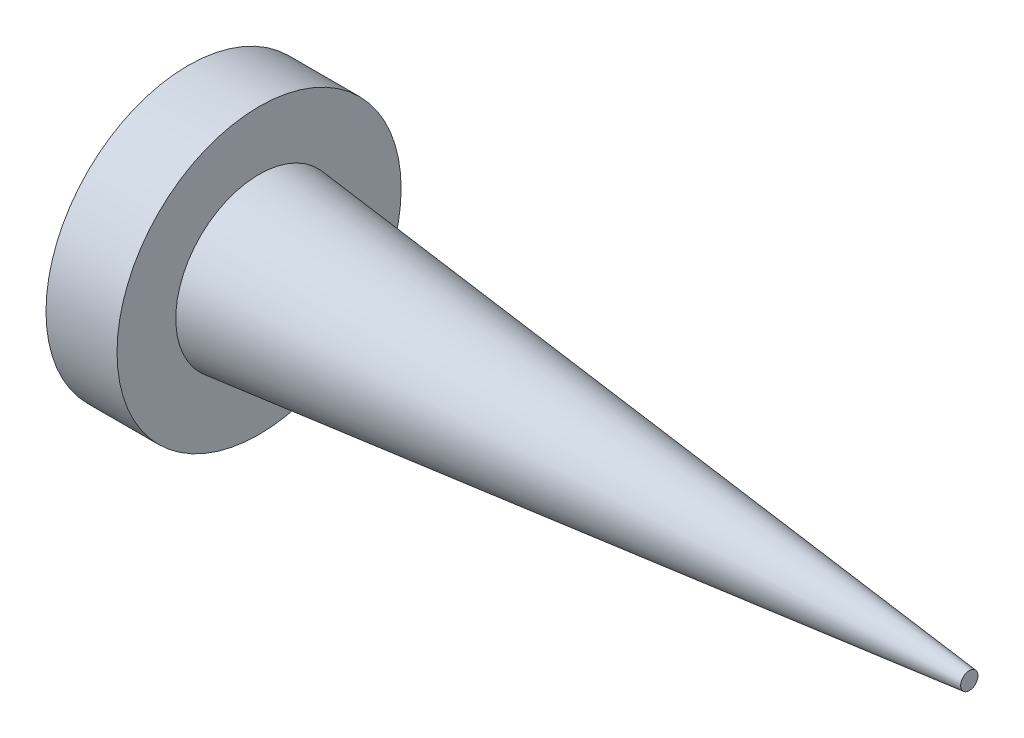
ISO-10303-21;
HEADER;
FILE_DESCRIPTION(('STEP AP214'),'2;1');
FILE_NAME('part.step','',(''),(''),'','','');
FILE_SCHEMA(('AUTOMOTIVE_DESIGN { 1 0 10303 214 1 1 1 1 }'));
ENDSEC;
DATA;
#1=APPLICATION_CONTEXT('core data for automotive mechanical design processes');
#2=APPLICATION_PROTOCOL_DEFINITION('international standard','automotive_design',2000,#1);
#3=PRODUCT_CONTEXT('',#1,'mechanical');
#4=PRODUCT('Part','Part','',(#3));
#5=PRODUCT_RELATED_PRODUCT_CATEGORY('part','',(#4));
#6=PRODUCT_DEFINITION_FORMATION('','',#4);
#7=PRODUCT_DEFINITION_CONTEXT('part definition',#1,'design');
#8=PRODUCT_DEFINITION('design','',#6,#7);
#9=PRODUCT_DEFINITION_SHAPE('','',#8);
#10=(LENGTH_UNIT() NAMED_UNIT(*) SI_UNIT(.MILLI.,.METRE.));
#11=(NAMED_UNIT(*) PLANE_ANGLE_UNIT() SI_UNIT($,.RADIAN.));
#12=(NAMED_UNIT(*) SI_UNIT($,.STERADIAN.) SOLID_ANGLE_UNIT());
#13=UNCERTAINTY_MEASURE_WITH_UNIT(LENGTH_MEASURE(1.E-05),#10,'distance_accuracy_value','');
#14=(GEOMETRIC_REPRESENTATION_CONTEXT(3) GLOBAL_UNCERTAINTY_ASSIGNED_CONTEXT((#13)) GLOBAL_UNIT_ASSIGNED_CONTEXT((#10,
#11,#12)) REPRESENTATION_CONTEXT('',''));
#15=CARTESIAN_POINT('',(0.,0.,0.));
#16=DIRECTION('',(0.,0.,1.));
#17=DIRECTION('',(1.,0.,0.));
#18=AXIS2_PLACEMENT_3D('',#15,#16,#17);
#19=CARTESIAN_POINT('',(1.,0.,0.));
#20=DIRECTION('',(-1.,0.,0.));
#21=DIRECTION('',(0.,0.,1.));
#22=AXIS2_PLACEMENT_3D('',#19,#20,#21);
#23=CYLINDRICAL_SURFACE('',#22,2.);
#24=CARTESIAN_POINT('',(1.,0.,0.));
#25=DIRECTION('',(1.,0.,0.));
#26=DIRECTION('',(0.,0.,-1.));
#27=AXIS2_PLACEMENT_3D('',#24,#25,#26);
#28=CIRCLE('',#27,2.);
#29=CARTESIAN_POINT('',(1.,0.,-2.));
#30=VERTEX_POINT('',#29);
#31=EDGE_CURVE('E38',#30,#30,#28,.T.);
#32=ORIENTED_EDGE('',*,*,#31,.F.);
#33=EDGE_LOOP('',(#32));
#34=FACE_BOUND('',#33,.T.);
#35=CARTESIAN_POINT('',(0.,0.,0.));
#36=DIRECTION('',(1.,0.,0.));
#37=DIRECTION('',(0.,0.,-1.));
#38=AXIS2_PLACEMENT_3D('',#35,#36,#37);
#39=CIRCLE('',#38,2.);
#40=CARTESIAN_POINT('',(0.,0.,-2.));
#41=VERTEX_POINT('',#40);
#42=EDGE_CURVE('E34',#41,#41,#39,.T.);
#43=ORIENTED_EDGE('',*,*,#42,.T.);
#44=EDGE_LOOP('',(#43));
#45=FACE_BOUND('',#44,.T.);
#46=ADVANCED_FACE('F31',(#34,#45),#23,.T.);
#47=CARTESIAN_POINT('',(1.,0.,0.));
#48=DIRECTION('',(1.,0.,0.));
#49=DIRECTION('',(0.,0.,-1.));
#50=AXIS2_PLACEMENT_3D('',#47,#48,#49);
#51=PLANE('',#50);
#52=CARTESIAN_POINT('',(1.,0.,0.));
#53=DIRECTION('',(1.,0.,0.));
#54=DIRECTION('',(0.,0.,-1.));
#55=AXIS2_PLACEMENT_3D('',#52,#53,#54);
#56=CIRCLE('',#55,1.17321010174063);
#57=CARTESIAN_POINT('',(1.,0.,-1.17321010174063));
#58=VERTEX_POINT('',#57);
#59=EDGE_CURVE('E10',#58,#58,#56,.T.);
#60=ORIENTED_EDGE('',*,*,#59,.F.);
#61=EDGE_LOOP('',(#60));
#62=FACE_BOUND('',#61,.T.);
#63=ORIENTED_EDGE('',*,*,#31,.T.);
#64=EDGE_LOOP('',(#63));
#65=FACE_BOUND('',#64,.T.);
#66=ADVANCED_FACE('F55',(#62,#65),#51,.T.);
#67=CARTESIAN_POINT('',(0.,0.,0.));
#68=DIRECTION('',(1.,0.,0.));
#69=DIRECTION('',(0.,0.,-1.));
#70=AXIS2_PLACEMENT_3D('',#67,#68,#69);
#71=PLANE('',#70);
#72=ORIENTED_EDGE('',*,*,#42,.F.);
#73=EDGE_LOOP('',(#72));
#74=FACE_BOUND('',#73,.T.);
#75=ADVANCED_FACE('F52',(#74),#71,.F.);
#76=CARTESIAN_POINT('',(1.,0.,0.));
#77=DIRECTION('',(-1.,0.,0.));
#78=DIRECTION('',(0.,0.,-1.));
#79=AXIS2_PLACEMENT_3D('',#76,#77,#78);
#80=CONICAL_SURFACE('',#79,1.17321010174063,0.10471975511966);
#81=CARTESIAN_POINT('',(11.,0.,0.));
#82=DIRECTION('',(1.,0.,0.));
#83=DIRECTION('',(0.,0.,-1.));
#84=AXIS2_PLACEMENT_3D('',#81,#82,#83);
#85=CIRCLE('',#84,0.122167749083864);
#86=CARTESIAN_POINT('',(11.,0.,-0.122167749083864));
#87=VERTEX_POINT('',#86);
#88=EDGE_CURVE('E44',#87,#87,#85,.T.);
#89=CARTESIAN_POINT('',(11.,0.,-0.122167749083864));
#90=CARTESIAN_POINT('',(10.8958333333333,0.,-0.133116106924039));
#91=CARTESIAN_POINT('',(10.7916666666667,0.,-0.144064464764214));
#92=CARTESIAN_POINT('',(10.5833333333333,0.,-0.165961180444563));
#93=CARTESIAN_POINT('',(10.4791666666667,0.,-0.176909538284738));
#94=CARTESIAN_POINT('',(10.2708333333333,0.,-0.198806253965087));
#95=CARTESIAN_POINT('',(10.1666666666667,0.,-0.209754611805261));
#96=CARTESIAN_POINT('',(9.95833333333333,0.,-0.231651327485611));
#97=CARTESIAN_POINT('',(9.85416666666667,0.,-0.242599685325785));
#98=CARTESIAN_POINT('',(9.64583333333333,0.,-0.264496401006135));
#99=CARTESIAN_POINT('',(9.54166666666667,0.,-0.275444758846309));
#100=CARTESIAN_POINT('',(9.33333333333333,0.,-0.297341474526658));
#101=CARTESIAN_POINT('',(9.22916666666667,0.,-0.308289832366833));
#102=CARTESIAN_POINT('',(9.02083333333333,0.,-0.330186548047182));
#103=CARTESIAN_POINT('',(8.91666666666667,0.,-0.341134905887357));
#104=CARTESIAN_POINT('',(8.70833333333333,0.,-0.363031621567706));
#105=CARTESIAN_POINT('',(8.60416666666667,0.,-0.373979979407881));
#106=CARTESIAN_POINT('',(8.39583333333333,0.,-0.39587669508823));
#107=CARTESIAN_POINT('',(8.29166666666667,0.,-0.406825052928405));
#108=CARTESIAN_POINT('',(8.08333333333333,0.,-0.428721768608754));
#109=CARTESIAN_POINT('',(7.97916666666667,0.,-0.439670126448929));
#110=CARTESIAN_POINT('',(7.77083333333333,0.,-0.461566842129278));
#111=CARTESIAN_POINT('',(7.66666666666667,0.,-0.472515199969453));
#112=CARTESIAN_POINT('',(7.45833333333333,0.,-0.494411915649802));
#113=CARTESIAN_POINT('',(7.35416666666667,0.,-0.505360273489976));
#114=CARTESIAN_POINT('',(7.14583333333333,0.,-0.527256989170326));
#115=CARTESIAN_POINT('',(7.04166666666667,0.,-0.5382053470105));
#116=CARTESIAN_POINT('',(6.83333333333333,0.,-0.56010206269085));
#117=CARTESIAN_POINT('',(6.72916666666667,0.,-0.571050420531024));
#118=CARTESIAN_POINT('',(6.52083333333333,0.,-0.592947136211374));
#119=CARTESIAN_POINT('',(6.41666666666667,0.,-0.603895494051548));
#120=CARTESIAN_POINT('',(6.20833333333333,0.,-0.625792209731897));
#121=CARTESIAN_POINT('',(6.10416666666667,0.,-0.636740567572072));
#122=CARTESIAN_POINT('',(5.89583333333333,0.,-0.658637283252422));
#123=CARTESIAN_POINT('',(5.79166666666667,0.,-0.669585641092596));
#124=CARTESIAN_POINT('',(5.58333333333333,0.,-0.691482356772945));
#125=CARTESIAN_POINT('',(5.47916666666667,0.,-0.70243071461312));
#126=CARTESIAN_POINT('',(5.27083333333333,0.,-0.724327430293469));
#127=CARTESIAN_POINT('',(5.16666666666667,0.,-0.735275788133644));
#128=CARTESIAN_POINT('',(4.95833333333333,0.,-0.757172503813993));
#129=CARTESIAN_POINT('',(4.85416666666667,0.,-0.768120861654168));
#130=CARTESIAN_POINT('',(4.64583333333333,0.,-0.790017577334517));
#131=CARTESIAN_POINT('',(4.54166666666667,0.,-0.800965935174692));
#132=CARTESIAN_POINT('',(4.33333333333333,0.,-0.822862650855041));
#133=CARTESIAN_POINT('',(4.22916666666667,0.,-0.833811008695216));
#134=CARTESIAN_POINT('',(4.02083333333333,0.,-0.855707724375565));
#135=CARTESIAN_POINT('',(3.91666666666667,0.,-0.866656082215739));
#136=CARTESIAN_POINT('',(3.70833333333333,0.,-0.888552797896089));
#137=CARTESIAN_POINT('',(3.60416666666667,0.,-0.899501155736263));
#138=CARTESIAN_POINT('',(3.39583333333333,0.,-0.921397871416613));
#139=CARTESIAN_POINT('',(3.29166666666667,0.,-0.932346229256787));
#140=CARTESIAN_POINT('',(3.08333333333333,0.,-0.954242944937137));
#141=CARTESIAN_POINT('',(2.97916666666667,0.,-0.965191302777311));
#142=CARTESIAN_POINT('',(2.77083333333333,0.,-0.987088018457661));
#143=CARTESIAN_POINT('',(2.66666666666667,0.,-0.998036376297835));
#144=CARTESIAN_POINT('',(2.45833333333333,0.,-1.01993309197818));
#145=CARTESIAN_POINT('',(2.35416666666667,0.,-1.03088144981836));
#146=CARTESIAN_POINT('',(2.14583333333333,0.,-1.05277816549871));
#147=CARTESIAN_POINT('',(2.04166666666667,0.,-1.06372652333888));
#148=CARTESIAN_POINT('',(1.83333333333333,0.,-1.08562323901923));
#149=CARTESIAN_POINT('',(1.72916666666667,0.,-1.09657159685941));
#150=CARTESIAN_POINT('',(1.52083333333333,0.,-1.11846831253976));
#151=CARTESIAN_POINT('',(1.41666666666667,0.,-1.12941667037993));
#152=CARTESIAN_POINT('',(1.20833333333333,0.,-1.15131338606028));
#153=CARTESIAN_POINT('',(1.10416666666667,0.,-1.16226174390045));
#154=CARTESIAN_POINT('',(1.,0.,-1.17321010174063));
#155=B_SPLINE_CURVE_WITH_KNOTS('',3,(#89,#90,#91,#92,#93,#94,#95,#96,#97,#98,#99,#100,#101,#102,
#103,#104,#105,#106,#107,#108,#109,#110,#111,#112,#113,#114,#115,#116,#117,#118,#119,#120,#121,
#122,#123,#124,#125,#126,#127,#128,#129,#130,#131,#132,#133,#134,#135,#136,#137,#138,#139,#140,
#141,#142,#143,#144,#145,#146,#147,#148,#149,#150,#151,#152,#153,#154),.UNSPECIFIED.,.F.,.F.,(4,
2,2,2,2,2,2,2,2,2,2,2,2,2,2,2,2,2,2,2,2,2,2,2,2,2,2,2,2,2,2,2,4),(0.,0.314221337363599,
0.628442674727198,0.942664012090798,1.2568853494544,1.571106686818,1.8853280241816,
2.19954936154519,2.51377069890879,2.82799203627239,3.14221337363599,3.45643471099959,
3.77065604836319,4.08487738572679,4.39909872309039,4.71332006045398,5.02754139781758,
5.34176273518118,5.65598407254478,5.97020540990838,6.28442674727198,6.59864808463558,
6.91286942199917,7.22709075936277,7.54131209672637,7.85553343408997,8.16975477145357,
8.48397610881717,8.79819744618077,9.11241878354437,9.42664012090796,9.74086145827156,
10.0550827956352),.UNSPECIFIED.);
#156=EDGE_CURVE('BSEAM54',#87,#58,#155,.T.);
#157=ORIENTED_EDGE('',*,*,#88,.F.);
#158=ORIENTED_EDGE('',*,*,#59,.T.);
#159=ORIENTED_EDGE('',*,*,#156,.T.);
#160=ORIENTED_EDGE('',*,*,#156,.F.);
#161=EDGE_LOOP('',(#157,#159,#158,#160));
#162=FACE_BOUND('',#161,.T.);
#163=ADVANCED_FACE('F54',(#162),#80,.T.);
#164=CARTESIAN_POINT('',(11.,0.,0.));
#165=DIRECTION('',(1.,0.,0.));
#166=DIRECTION('',(0.,0.,-1.));
#167=AXIS2_PLACEMENT_3D('',#164,#165,#166);
#168=PLANE('',#167);
#169=ORIENTED_EDGE('',*,*,#88,.T.);
#170=EDGE_LOOP('',(#169));
#171=FACE_BOUND('',#170,.T.);
#172=ADVANCED_FACE('F60',(#171),#168,.T.);
#173=CLOSED_SHELL('',(#46,#66,#75,#163,#172));
#174=MANIFOLD_SOLID_BREP('B2',#173);
#175=ADVANCED_BREP_SHAPE_REPRESENTATION('',(#18,#174),#14);
#176=SHAPE_DEFINITION_REPRESENTATION(#9,#175);
ENDSEC;
END-ISO-10303-21;
